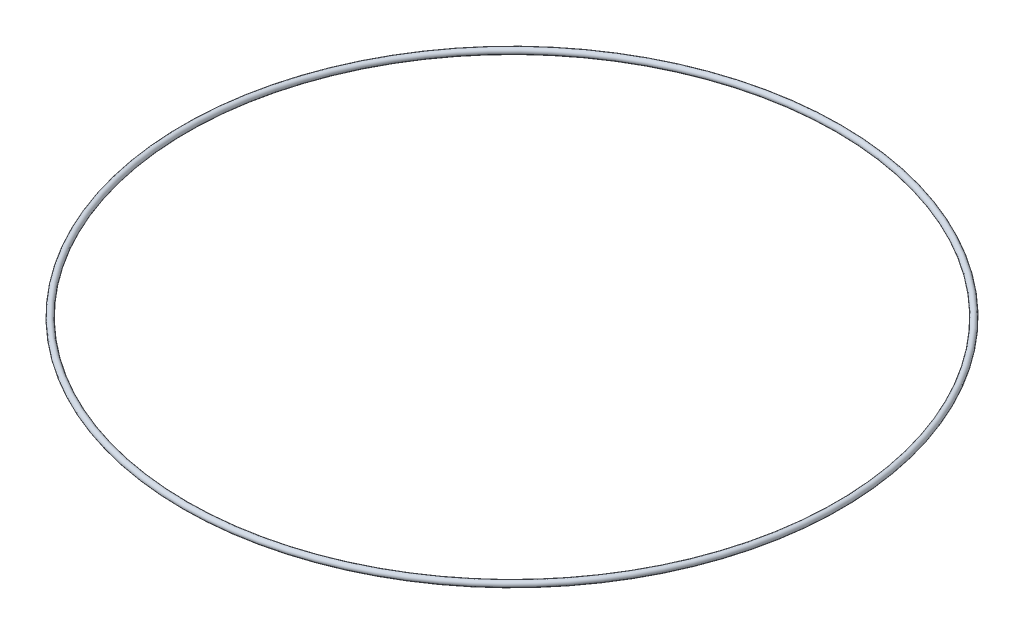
from build123d import *

# Parameters (mm, degrees)
SKETCH1_R = 2.667


with BuildPart() as part:
    # Sketch1 → Revolve1 (revolve)
    with BuildSketch(Plane.XY, mode=Mode.PRIVATE) as revolve1_sk:
        with Locations((-294.005, 0)):
            Circle(SKETCH1_R)
    revolve(revolve1_sk.sketch.rotate(Axis((0, 96.52, 0), (0, -1, 0)), 270), axis=Axis((0, 96.52, 0), (0, -1, 0)))


solid = part.part
